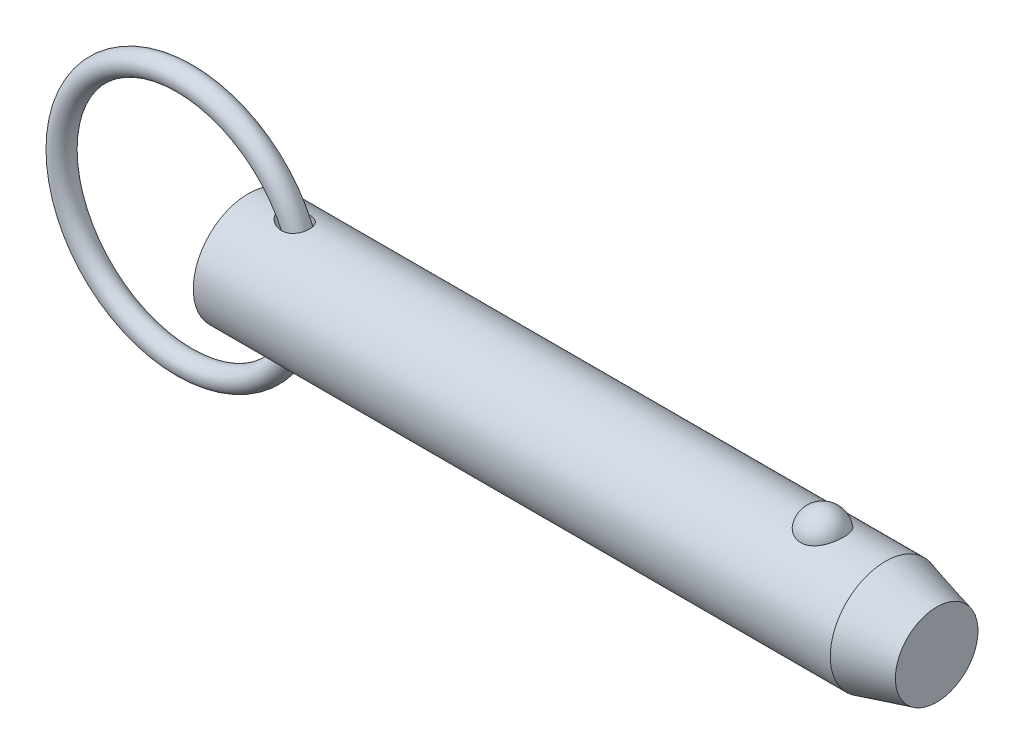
ISO-10303-21;
HEADER;
FILE_DESCRIPTION(('STEP AP214'),'2;1');
FILE_NAME('part.step','',(''),(''),'','','');
FILE_SCHEMA(('AUTOMOTIVE_DESIGN { 1 0 10303 214 1 1 1 1 }'));
ENDSEC;
DATA;
#1=APPLICATION_CONTEXT('core data for automotive mechanical design processes');
#2=APPLICATION_PROTOCOL_DEFINITION('international standard','automotive_design',2000,#1);
#3=PRODUCT_CONTEXT('',#1,'mechanical');
#4=PRODUCT('Part','Part','',(#3));
#5=PRODUCT_RELATED_PRODUCT_CATEGORY('part','',(#4));
#6=PRODUCT_DEFINITION_FORMATION('','',#4);
#7=PRODUCT_DEFINITION_CONTEXT('part definition',#1,'design');
#8=PRODUCT_DEFINITION('design','',#6,#7);
#9=PRODUCT_DEFINITION_SHAPE('','',#8);
#10=(LENGTH_UNIT() NAMED_UNIT(*) SI_UNIT(.MILLI.,.METRE.));
#11=(NAMED_UNIT(*) PLANE_ANGLE_UNIT() SI_UNIT($,.RADIAN.));
#12=(NAMED_UNIT(*) SI_UNIT($,.STERADIAN.) SOLID_ANGLE_UNIT());
#13=UNCERTAINTY_MEASURE_WITH_UNIT(LENGTH_MEASURE(1.E-05),#10,'distance_accuracy_value','');
#14=(GEOMETRIC_REPRESENTATION_CONTEXT(3) GLOBAL_UNCERTAINTY_ASSIGNED_CONTEXT((#13)) GLOBAL_UNIT_ASSIGNED_CONTEXT((#10,
#11,#12)) REPRESENTATION_CONTEXT('',''));
#15=CARTESIAN_POINT('',(0.,0.,0.));
#16=DIRECTION('',(0.,0.,1.));
#17=DIRECTION('',(1.,0.,0.));
#18=AXIS2_PLACEMENT_3D('',#15,#16,#17);
#19=CARTESIAN_POINT('',(-8.23730968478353,0.,0.));
#20=DIRECTION('',(0.,0.,1.));
#21=DIRECTION('',(1.,0.,0.));
#22=AXIS2_PLACEMENT_3D('',#19,#20,#21);
#23=TOROIDAL_SURFACE('',#22,15.875,1.422);
#24=CARTESIAN_POINT('',(9.05969031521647,0.,0.));
#25=VERTEX_POINT('',#24);
#26=VERTEX_LOOP('',#25);
#27=FACE_BOUND('',#26,.T.);
#28=ADVANCED_FACE('P0_F12',(#27),#23,.T.);
#29=CLOSED_SHELL('',(#28));
#30=MANIFOLD_SOLID_BREP('P0_B1',#29);
#31=CARTESIAN_POINT('',(0.,0.,0.));
#32=DIRECTION('',(1.,0.,0.));
#33=DIRECTION('',(0.,0.,-1.));
#34=AXIS2_PLACEMENT_3D('',#31,#32,#33);
#35=CYLINDRICAL_SURFACE('',#34,7.11);
#36=CARTESIAN_POINT('',(3.98467340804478,7.10072679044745,-0.363013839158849));
#37=CARTESIAN_POINT('',(4.00971652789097,7.09600153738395,-0.45539194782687));
#38=CARTESIAN_POINT('',(4.04401947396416,7.08958406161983,-0.545230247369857));
#39=CARTESIAN_POINT('',(4.12810160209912,7.07427055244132,-0.717157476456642));
#40=CARTESIAN_POINT('',(4.17791765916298,7.06536861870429,-0.799227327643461));
#41=CARTESIAN_POINT('',(4.28924471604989,7.04620300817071,-0.953469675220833));
#42=CARTESIAN_POINT('',(4.35063580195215,7.035953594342,-1.02573162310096));
#43=CARTESIAN_POINT('',(4.48282610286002,7.01493313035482,-1.16081412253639));
#44=CARTESIAN_POINT('',(4.55362244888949,7.00416223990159,-1.22363754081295));
#45=CARTESIAN_POINT('',(4.71659336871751,6.98090398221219,-1.35055080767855));
#46=CARTESIAN_POINT('',(4.81029272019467,6.96847103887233,-1.41269256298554));
#47=CARTESIAN_POINT('',(5.0057240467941,6.94515366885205,-1.52319699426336));
#48=CARTESIAN_POINT('',(5.10746392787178,6.93427079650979,-1.57154588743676));
#49=CARTESIAN_POINT('',(5.33503739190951,6.91346066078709,-1.66091325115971));
#50=CARTESIAN_POINT('',(5.46199550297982,6.90402388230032,-1.69921932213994));
#51=CARTESIAN_POINT('',(5.72084799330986,6.89024030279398,-1.75428261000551));
#52=CARTESIAN_POINT('',(5.85274301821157,6.88589416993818,-1.77103699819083));
#53=CARTESIAN_POINT('',(6.11557710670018,6.88337277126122,-1.78081990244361));
#54=CARTESIAN_POINT('',(6.24650031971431,6.88510489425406,-1.77420448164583));
#55=CARTESIAN_POINT('',(6.50446311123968,6.89478744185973,-1.73620392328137));
#56=CARTESIAN_POINT('',(6.6315075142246,6.90272978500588,-1.70485097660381));
#57=CARTESIAN_POINT('',(6.85933269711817,6.92243075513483,-1.62281888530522));
#58=CARTESIAN_POINT('',(6.96133251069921,6.93352131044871,-1.5753580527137));
#59=CARTESIAN_POINT('',(7.15436649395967,6.95824811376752,-1.46226310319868));
#60=CARTESIAN_POINT('',(7.24540699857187,6.97188287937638,-1.3966395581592));
#61=CARTESIAN_POINT('',(7.40446019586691,6.99838217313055,-1.25668991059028));
#62=CARTESIAN_POINT('',(7.473875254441,7.01118308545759,-1.18393777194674));
#63=CARTESIAN_POINT('',(7.59904891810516,7.03582803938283,-1.02736918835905));
#64=CARTESIAN_POINT('',(7.65481029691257,7.04767227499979,-0.943554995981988));
#65=CARTESIAN_POINT('',(7.74982438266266,7.06873077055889,-0.76979592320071));
#66=CARTESIAN_POINT('',(7.7894903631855,7.07800861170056,-0.680084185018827));
#67=CARTESIAN_POINT('',(7.85354088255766,7.09334756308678,-0.495102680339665));
#68=CARTESIAN_POINT('',(7.87792559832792,7.09940871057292,-0.399832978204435));
#69=CARTESIAN_POINT('',(7.9108898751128,7.10766731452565,-0.206294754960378));
#70=CARTESIAN_POINT('',(7.91944662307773,7.10985919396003,-0.108022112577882));
#71=CARTESIAN_POINT('',(7.920501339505,7.11012756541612,0.0886168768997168));
#72=CARTESIAN_POINT('',(7.91299895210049,7.10820396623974,0.186983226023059));
#73=CARTESIAN_POINT('',(7.88205794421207,7.10043733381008,0.381270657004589));
#74=CARTESIAN_POINT('',(7.85857985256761,7.09458459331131,0.477185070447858));
#75=CARTESIAN_POINT('',(7.79617406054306,7.07958431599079,0.663575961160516));
#76=CARTESIAN_POINT('',(7.75724672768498,7.07043685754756,0.754052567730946));
#77=CARTESIAN_POINT('',(7.66496731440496,7.04987259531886,0.926798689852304));
#78=CARTESIAN_POINT('',(7.61164530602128,7.0384605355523,1.00908483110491));
#79=CARTESIAN_POINT('',(7.49191707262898,7.01461776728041,1.16333092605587));
#80=CARTESIAN_POINT('',(7.42551210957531,7.00218715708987,1.235291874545));
#81=CARTESIAN_POINT('',(7.28164031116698,6.97770944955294,1.36680167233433));
#82=CARTESIAN_POINT('',(7.20420170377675,6.96566146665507,1.42638126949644));
#83=CARTESIAN_POINT('',(7.0403906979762,6.94319963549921,1.53199377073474));
#84=CARTESIAN_POINT('',(6.95401827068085,6.93278579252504,1.57802663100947));
#85=CARTESIAN_POINT('',(6.7731858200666,6.91444459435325,1.65656940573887));
#86=CARTESIAN_POINT('',(6.67860569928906,6.90656682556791,1.68881327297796));
#87=CARTESIAN_POINT('',(6.48544119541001,6.89422806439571,1.73849768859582));
#88=CARTESIAN_POINT('',(6.38685561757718,6.88976809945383,1.755933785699));
#89=CARTESIAN_POINT('',(6.18089829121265,6.88429907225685,1.77726234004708));
#90=CARTESIAN_POINT('',(6.07340937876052,6.88356485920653,1.78007646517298));
#91=CARTESIAN_POINT('',(5.85921220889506,6.886086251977,1.77029087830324));
#92=CARTESIAN_POINT('',(5.75250426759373,6.88934339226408,1.75768523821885));
#93=CARTESIAN_POINT('',(5.52848027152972,6.89994454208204,1.71563399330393));
#94=CARTESIAN_POINT('',(5.41155168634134,6.90775772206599,1.68424184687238));
#95=CARTESIAN_POINT('',(5.18376466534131,6.92670168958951,1.60454711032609));
#96=CARTESIAN_POINT('',(5.07291446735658,6.9378368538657,1.5562221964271));
#97=CARTESIAN_POINT('',(4.84835244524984,6.96347168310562,1.43744827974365));
#98=CARTESIAN_POINT('',(4.73562531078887,6.97820486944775,1.36517310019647));
#99=CARTESIAN_POINT('',(4.52504912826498,7.00822340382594,1.20158053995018));
#100=CARTESIAN_POINT('',(4.42717478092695,7.02350775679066,1.11029618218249));
#101=CARTESIAN_POINT('',(4.27935716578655,7.04784659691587,0.940654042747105));
#102=CARTESIAN_POINT('',(4.2239722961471,7.05736064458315,0.867099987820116));
#103=CARTESIAN_POINT('',(4.12558347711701,7.07469854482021,0.711919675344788));
#104=CARTESIAN_POINT('',(4.08256922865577,7.0825238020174,0.630300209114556));
#105=CARTESIAN_POINT('',(4.01142860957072,7.09565978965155,0.459428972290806));
#106=CARTESIAN_POINT('',(3.98346043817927,7.10094374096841,0.370107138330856));
#107=CARTESIAN_POINT('',(3.95517285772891,7.1063173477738,0.233358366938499));
#108=CARTESIAN_POINT('',(3.94802115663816,7.1076831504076,0.187321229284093));
#109=CARTESIAN_POINT('',(3.93842121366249,7.10951900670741,0.0947476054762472));
#110=CARTESIAN_POINT('',(3.93597129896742,7.10998937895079,0.0482113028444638));
#111=CARTESIAN_POINT('',(3.93584361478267,7.11001358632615,-0.0598597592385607));
#112=CARTESIAN_POINT('',(3.9399538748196,7.10922402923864,-0.121405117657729));
#113=CARTESIAN_POINT('',(3.95632793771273,7.10609781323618,-0.243320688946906));
#114=CARTESIAN_POINT('',(3.96859135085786,7.10376122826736,-0.303690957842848));
#115=CARTESIAN_POINT('',(3.98467340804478,7.10072679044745,-0.363013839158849));
#116=B_SPLINE_CURVE_WITH_KNOTS('',3,(#36,#37,#38,#39,#40,#41,#42,#43,#44,#45,#46,#47,#48,#49,
#50,#51,#52,#53,#54,#55,#56,#57,#58,#59,#60,#61,#62,#63,#64,#65,#66,#67,#68,#69,#70,#71,#72,#73,
#74,#75,#76,#77,#78,#79,#80,#81,#82,#83,#84,#85,#86,#87,#88,#89,#90,#91,#92,#93,#94,#95,#96,#97,
#98,#99,#100,#101,#102,#103,#104,#105,#106,#107,#108,#109,#110,#111,#112,#113,#114,#115),
.UNSPECIFIED.,.T.,.F.,(4,2,2,2,2,2,2,2,2,2,2,2,2,2,2,2,2,2,2,2,2,2,2,2,2,2,2,2,2,2,2,2,2,2,2,2,
2,2,2,4),(0.,0.287206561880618,0.575101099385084,0.860162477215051,1.14513709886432,
1.48324846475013,1.82169652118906,2.21865672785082,2.6156690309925,3.00665870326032,
3.39714041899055,3.73437585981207,4.07141541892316,4.37402271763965,4.67656849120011,
4.97076150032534,5.26495110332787,5.55956439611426,5.85418421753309,6.14953461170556,
6.44487798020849,6.73960905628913,7.03431171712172,7.32827352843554,7.6222362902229,
7.9216396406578,8.22113296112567,8.54242840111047,8.86384740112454,9.22635035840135,
9.58933304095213,9.99153142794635,10.3930368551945,10.6697219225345,10.9461759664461,
11.2254825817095,11.3650959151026,11.5046595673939,11.6891051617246,11.8735419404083),.UNSPECIFIED.);
#117=CARTESIAN_POINT('',(3.98467340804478,7.10072679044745,-0.363013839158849));
#118=VERTEX_POINT('',#117);
#119=EDGE_CURVE('P1_E40',#118,#118,#116,.T.);
#120=ORIENTED_EDGE('',*,*,#119,.T.);
#121=EDGE_LOOP('',(#120));
#122=FACE_BOUND('',#121,.T.);
#123=CARTESIAN_POINT('',(82.2362796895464,0.,0.));
#124=DIRECTION('',(1.,0.,0.));
#125=DIRECTION('',(0.,0.,-1.));
#126=AXIS2_PLACEMENT_3D('',#123,#124,#125);
#127=CIRCLE('',#126,7.11);
#128=CARTESIAN_POINT('',(82.2362796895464,0.,-7.11));
#129=VERTEX_POINT('',#128);
#130=EDGE_CURVE('P1_E25',#129,#129,#127,.T.);
#131=ORIENTED_EDGE('',*,*,#130,.F.);
#132=EDGE_LOOP('',(#131));
#133=FACE_BOUND('',#132,.T.);
#134=CARTESIAN_POINT('',(0.,0.,0.));
#135=DIRECTION('',(1.,0.,0.));
#136=DIRECTION('',(0.,0.,-1.));
#137=AXIS2_PLACEMENT_3D('',#134,#135,#136);
#138=CIRCLE('',#137,7.11);
#139=CARTESIAN_POINT('',(0.,0.,-7.11));
#140=VERTEX_POINT('',#139);
#141=EDGE_CURVE('P1_E9',#140,#140,#138,.T.);
#142=ORIENTED_EDGE('',*,*,#141,.T.);
#143=EDGE_LOOP('',(#142));
#144=FACE_BOUND('',#143,.T.);
#145=CARTESIAN_POINT('',(74.129258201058,6.53646663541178,2.79762469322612));
#146=CARTESIAN_POINT('',(73.9844296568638,6.53647876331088,2.79761243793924));
#147=CARTESIAN_POINT('',(73.839368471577,6.54144531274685,2.78608115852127));
#148=CARTESIAN_POINT('',(73.5532920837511,6.56077791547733,2.74023282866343));
#149=CARTESIAN_POINT('',(73.4122884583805,6.57516852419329,2.70585624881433));
#150=CARTESIAN_POINT('',(73.1388833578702,6.61165072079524,2.61544042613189));
#151=CARTESIAN_POINT('',(73.0064602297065,6.63372195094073,2.55945840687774));
#152=CARTESIAN_POINT('',(72.7532337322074,6.68316012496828,2.42742958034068));
#153=CARTESIAN_POINT('',(72.6324254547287,6.71052481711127,2.35139129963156));
#154=CARTESIAN_POINT('',(72.4016372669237,6.76860821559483,2.17866150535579));
#155=CARTESIAN_POINT('',(72.2920857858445,6.79940242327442,2.08142342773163));
#156=CARTESIAN_POINT('',(72.0903340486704,6.86050242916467,1.87020907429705));
#157=CARTESIAN_POINT('',(71.9981390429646,6.89080807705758,1.75622775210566));
#158=CARTESIAN_POINT('',(71.8292547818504,6.94923069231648,1.50900646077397));
#159=CARTESIAN_POINT('',(71.7534289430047,6.97719213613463,1.37513873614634));
#160=CARTESIAN_POINT('',(71.6242063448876,7.02647251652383,1.09584817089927));
#161=CARTESIAN_POINT('',(71.5708109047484,7.04779106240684,0.950424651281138));
#162=CARTESIAN_POINT('',(71.4871019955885,7.08180248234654,0.650508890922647));
#163=CARTESIAN_POINT('',(71.4570253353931,7.09440672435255,0.495940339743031));
#164=CARTESIAN_POINT('',(71.421473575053,7.10935121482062,0.183515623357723));
#165=CARTESIAN_POINT('',(71.4159974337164,7.11169189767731,0.025659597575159));
#166=CARTESIAN_POINT('',(71.429700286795,7.10589702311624,-0.287512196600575));
#167=CARTESIAN_POINT('',(71.4486823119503,7.0978451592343,-0.442838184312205));
#168=CARTESIAN_POINT('',(71.5105745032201,7.07221860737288,-0.747830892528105));
#169=CARTESIAN_POINT('',(71.5534850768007,7.05464375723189,-0.897497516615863));
#170=CARTESIAN_POINT('',(71.6624527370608,7.01171031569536,-1.1872286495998));
#171=CARTESIAN_POINT('',(71.7285458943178,6.98633960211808,-1.32727778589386));
#172=CARTESIAN_POINT('',(71.8825362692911,6.93042258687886,-1.59370324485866));
#173=CARTESIAN_POINT('',(71.9704355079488,6.89987580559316,-1.72007829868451));
#174=CARTESIAN_POINT('',(72.1669269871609,6.83659510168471,-1.95657345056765));
#175=CARTESIAN_POINT('',(72.2756640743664,6.80384697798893,-2.0665695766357));
#176=CARTESIAN_POINT('',(72.5109686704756,6.7400183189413,-2.26611005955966));
#177=CARTESIAN_POINT('',(72.6375350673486,6.70893767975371,-2.35565569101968));
#178=CARTESIAN_POINT('',(72.9028454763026,6.65264442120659,-2.51019726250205));
#179=CARTESIAN_POINT('',(73.0413230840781,6.62733449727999,-2.5756139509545));
#180=CARTESIAN_POINT('',(73.3285194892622,6.58495995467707,-2.68211134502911));
#181=CARTESIAN_POINT('',(73.4772343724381,6.56789220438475,-2.72320129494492));
#182=CARTESIAN_POINT('',(73.7726268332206,6.54478663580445,-2.77825810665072));
#183=CARTESIAN_POINT('',(73.9190295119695,6.53823639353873,-2.7934872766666));
#184=CARTESIAN_POINT('',(74.2124700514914,6.53532718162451,-2.80028921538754));
#185=CARTESIAN_POINT('',(74.3595077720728,6.53896606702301,-2.79186696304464));
#186=CARTESIAN_POINT('',(74.6449210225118,6.55570357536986,-2.75232178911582));
#187=CARTESIAN_POINT('',(74.7834221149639,6.56848455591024,-2.72196077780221));
#188=CARTESIAN_POINT('',(75.0531142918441,6.60173528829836,-2.64028774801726));
#189=CARTESIAN_POINT('',(75.184304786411,6.62220565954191,-2.58897404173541));
#190=CARTESIAN_POINT('',(75.4388462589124,6.6691792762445,-2.46547820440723));
#191=CARTESIAN_POINT('',(75.5619691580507,6.69580233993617,-2.39287266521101));
#192=CARTESIAN_POINT('',(75.7944418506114,6.75207041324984,-2.22915269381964));
#193=CARTESIAN_POINT('',(75.9037884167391,6.78171612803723,-2.13803393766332));
#194=CARTESIAN_POINT('',(76.111642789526,6.8426462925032,-1.93445592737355));
#195=CARTESIAN_POINT('',(76.2093178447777,6.87393748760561,-1.82114774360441));
#196=CARTESIAN_POINT('',(76.3850112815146,6.93345710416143,-1.5794778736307));
#197=CARTESIAN_POINT('',(76.4630261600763,6.96168497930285,-1.45111351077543));
#198=CARTESIAN_POINT('',(76.5999857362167,7.01307558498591,-1.17842708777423));
#199=CARTESIAN_POINT('',(76.6582588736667,7.03605262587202,-1.03373189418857));
#200=CARTESIAN_POINT('',(76.7510815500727,7.07340932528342,-0.735867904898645));
#201=CARTESIAN_POINT('',(76.7856311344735,7.08778900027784,-0.582699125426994));
#202=CARTESIAN_POINT('',(76.830274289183,7.10647639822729,-0.272420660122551));
#203=CARTESIAN_POINT('',(76.84039710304,7.11079616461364,-0.115315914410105));
#204=CARTESIAN_POINT('',(76.836061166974,7.10896059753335,0.198488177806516));
#205=CARTESIAN_POINT('',(76.8216031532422,7.10280557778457,0.35518753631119));
#206=CARTESIAN_POINT('',(76.7685727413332,7.08071500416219,0.662724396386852));
#207=CARTESIAN_POINT('',(76.7301505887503,7.06484039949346,0.81359224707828));
#208=CARTESIAN_POINT('',(76.6301012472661,7.0249589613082,1.10629159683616));
#209=CARTESIAN_POINT('',(76.5684724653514,7.00095156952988,1.24812247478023));
#210=CARTESIAN_POINT('',(76.4227668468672,6.94706632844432,1.51976439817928));
#211=CARTESIAN_POINT('',(76.3385448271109,6.91715085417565,1.6494901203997));
#212=CARTESIAN_POINT('',(76.1495861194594,6.85470565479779,1.89231285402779));
#213=CARTESIAN_POINT('',(76.0448501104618,6.82217601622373,2.0054104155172));
#214=CARTESIAN_POINT('',(75.8171030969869,6.75805358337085,2.21190674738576));
#215=CARTESIAN_POINT('',(75.694082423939,6.72646129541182,2.30529503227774));
#216=CARTESIAN_POINT('',(75.4327347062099,6.66789520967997,2.4695990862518));
#217=CARTESIAN_POINT('',(75.2944019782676,6.64092313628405,2.5405064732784));
#218=CARTESIAN_POINT('',(75.0111828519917,6.5957258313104,2.65560045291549));
#219=CARTESIAN_POINT('',(74.8666660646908,6.57724013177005,2.7005953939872));
#220=CARTESIAN_POINT('',(74.5715469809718,6.55006426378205,2.76587321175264));
#221=CARTESIAN_POINT('',(74.4209640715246,6.54134511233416,2.78622922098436));
#222=CARTESIAN_POINT('',(74.2230463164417,6.53697847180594,2.79642434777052));
#223=CARTESIAN_POINT('',(74.1761644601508,6.53646270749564,2.79762866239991));
#224=CARTESIAN_POINT('',(74.129258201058,6.53646663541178,2.79762469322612));
#225=B_SPLINE_CURVE_WITH_KNOTS('',3,(#145,#146,#147,#148,#149,#150,#151,#152,#153,#154,#155,
#156,#157,#158,#159,#160,#161,#162,#163,#164,#165,#166,#167,#168,#169,#170,#171,#172,#173,#174,
#175,#176,#177,#178,#179,#180,#181,#182,#183,#184,#185,#186,#187,#188,#189,#190,#191,#192,#193,
#194,#195,#196,#197,#198,#199,#200,#201,#202,#203,#204,#205,#206,#207,#208,#209,#210,#211,#212,
#213,#214,#215,#216,#217,#218,#219,#220,#221,#222,#223,#224),.UNSPECIFIED.,.T.,.F.,(4,2,2,2,2,2,
2,2,2,2,2,2,2,2,2,2,2,2,2,2,2,2,2,2,2,2,2,2,2,2,2,2,2,2,2,2,2,2,2,4),(0.,0.434355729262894,
0.869847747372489,1.30419416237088,1.73835621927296,2.18541922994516,2.6326172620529,
3.09954261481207,3.56649542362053,4.03813031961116,4.50974525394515,4.97758575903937,
5.4454342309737,5.91401389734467,6.38263700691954,6.85464418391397,7.32662193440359,
7.78992971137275,8.25306131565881,8.69285754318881,9.13256119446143,9.5576862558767,
9.98284556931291,10.4171106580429,10.851477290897,11.3079089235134,11.7644218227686,
12.2351898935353,12.7059570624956,13.1761603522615,13.6463495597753,14.1136200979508,
14.5809227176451,15.0513032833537,15.5216682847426,15.9922828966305,16.4630727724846,
16.9182457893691,17.3720644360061,17.5127411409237),.UNSPECIFIED.);
#226=CARTESIAN_POINT('',(74.129258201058,6.53646663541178,2.79762469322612));
#227=VERTEX_POINT('',#226);
#228=EDGE_CURVE('P1_E34',#227,#227,#225,.T.);
#229=ORIENTED_EDGE('',*,*,#228,.T.);
#230=EDGE_LOOP('',(#229));
#231=FACE_BOUND('',#230,.T.);
#232=CARTESIAN_POINT('',(3.98467340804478,-7.10072679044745,-0.363013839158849));
#233=CARTESIAN_POINT('',(3.96426456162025,-7.10457733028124,-0.287714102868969));
#234=CARTESIAN_POINT('',(3.95000501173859,-7.10730349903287,-0.210695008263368));
#235=CARTESIAN_POINT('',(3.93481801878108,-7.11020840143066,-0.0553038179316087));
#236=CARTESIAN_POINT('',(3.93388435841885,-7.11038832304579,0.0230676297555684));
#237=CARTESIAN_POINT('',(3.94541910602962,-7.10817995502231,0.178714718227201));
#238=CARTESIAN_POINT('',(3.95787987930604,-7.10579312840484,0.25599095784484));
#239=CARTESIAN_POINT('',(3.99523775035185,-7.09872642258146,0.407352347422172));
#240=CARTESIAN_POINT('',(4.02014065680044,-7.09404547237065,0.481435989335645));
#241=CARTESIAN_POINT('',(4.08119600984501,-7.08278363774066,0.625775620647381));
#242=CARTESIAN_POINT('',(4.11749458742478,-7.07617815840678,0.695967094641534));
#243=CARTESIAN_POINT('',(4.19940836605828,-7.06165305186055,0.830508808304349));
#244=CARTESIAN_POINT('',(4.24502952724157,-7.0537325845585,0.894855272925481));
#245=CARTESIAN_POINT('',(4.36790232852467,-7.03310314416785,1.04688574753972));
#246=CARTESIAN_POINT('',(4.44977459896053,-7.01993229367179,1.13078695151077));
#247=CARTESIAN_POINT('',(4.62610796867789,-6.99351259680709,1.28411726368));
#248=CARTESIAN_POINT('',(4.7205898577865,-6.98026365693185,1.35352197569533));
#249=CARTESIAN_POINT('',(4.92036507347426,-6.9549104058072,1.47831921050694));
#250=CARTESIAN_POINT('',(5.02579054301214,-6.94282458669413,1.53350332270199));
#251=CARTESIAN_POINT('',(5.24378330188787,-6.92129098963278,1.62793610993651));
#252=CARTESIAN_POINT('',(5.35635066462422,-6.91184323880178,1.66718462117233));
#253=CARTESIAN_POINT('',(5.60134354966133,-6.89573491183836,1.73269893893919));
#254=CARTESIAN_POINT('',(5.73444697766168,-6.8895970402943,1.75661057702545));
#255=CARTESIAN_POINT('',(6.00300738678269,-6.88344616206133,1.78057487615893));
#256=CARTESIAN_POINT('',(6.13846360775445,-6.88343121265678,1.78063510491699));
#257=CARTESIAN_POINT('',(6.39660470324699,-6.88981379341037,1.75576480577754));
#258=CARTESIAN_POINT('',(6.51947843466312,-6.89572457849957,1.73273121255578));
#259=CARTESIAN_POINT('',(6.75813770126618,-6.91274434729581,1.66352936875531));
#260=CARTESIAN_POINT('',(6.87393155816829,-6.92384709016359,1.61738888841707));
#261=CARTESIAN_POINT('',(7.07801861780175,-6.94787316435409,1.51052664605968));
#262=CARTESIAN_POINT('',(7.16789841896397,-6.96033024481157,1.45271574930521));
#263=CARTESIAN_POINT('',(7.33546773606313,-6.98638661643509,1.32171912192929));
#264=CARTESIAN_POINT('',(7.41316182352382,-6.99998547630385,1.24853918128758));
#265=CARTESIAN_POINT('',(7.54861420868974,-7.02559503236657,1.09486170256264));
#266=CARTESIAN_POINT('',(7.60741145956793,-7.03764930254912,1.01528346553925));
#267=CARTESIAN_POINT('',(7.71070740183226,-7.0598657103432,0.847099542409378));
#268=CARTESIAN_POINT('',(7.75520788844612,-7.0700280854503,0.758494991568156));
#269=CARTESIAN_POINT('',(7.82836147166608,-7.08722075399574,0.575936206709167));
#270=CARTESIAN_POINT('',(7.85719783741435,-7.09428707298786,0.482058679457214));
#271=CARTESIAN_POINT('',(7.89918378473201,-7.10470260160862,0.29065874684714));
#272=CARTESIAN_POINT('',(7.91233308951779,-7.10805174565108,0.193136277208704));
#273=CARTESIAN_POINT('',(7.92267451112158,-7.11067890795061,-0.00313968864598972));
#274=CARTESIAN_POINT('',(7.91981203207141,-7.10994299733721,-0.10189624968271));
#275=CARTESIAN_POINT('',(7.89806489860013,-7.10444651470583,-0.297516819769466));
#276=CARTESIAN_POINT('',(7.87918005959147,-7.09968589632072,-0.394380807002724));
#277=CARTESIAN_POINT('',(7.82577988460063,-7.0866471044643,-0.58355375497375));
#278=CARTESIAN_POINT('',(7.79124976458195,-7.07836560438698,-0.675858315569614));
#279=CARTESIAN_POINT('',(7.70736343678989,-7.05919003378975,-0.853167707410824));
#280=CARTESIAN_POINT('',(7.65800801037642,-7.04829610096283,-0.938172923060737));
#281=CARTESIAN_POINT('',(7.54590141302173,-7.02513961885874,-1.09819812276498));
#282=CARTESIAN_POINT('',(7.48319521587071,-7.01288172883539,-1.17325029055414));
#283=CARTESIAN_POINT('',(7.34599775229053,-6.98832192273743,-1.31164333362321));
#284=CARTESIAN_POINT('',(7.27150757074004,-6.97602001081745,-1.37498528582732));
#285=CARTESIAN_POINT('',(7.11277776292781,-6.95268608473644,-1.48849974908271));
#286=CARTESIAN_POINT('',(7.02852525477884,-6.94165578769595,-1.53865456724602));
#287=CARTESIAN_POINT('',(6.85282430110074,-6.92200320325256,-1.62478650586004));
#288=CARTESIAN_POINT('',(6.76137511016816,-6.91338116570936,-1.66076215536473));
#289=CARTESIAN_POINT('',(6.57061179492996,-6.89906044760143,-1.71930563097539));
#290=CARTESIAN_POINT('',(6.47113516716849,-6.89347290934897,-1.74136795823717));
#291=CARTESIAN_POINT('',(6.26989833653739,-6.88605020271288,-1.7704895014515));
#292=CARTESIAN_POINT('',(6.16813737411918,-6.88421630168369,-1.77754365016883));
#293=CARTESIAN_POINT('',(5.95492537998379,-6.88424071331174,-1.77745174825));
#294=CARTESIAN_POINT('',(5.8434768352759,-6.88646827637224,-1.76888555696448));
#295=CARTESIAN_POINT('',(5.62307560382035,-6.89483827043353,-1.73596677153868));
#296=CARTESIAN_POINT('',(5.51412477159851,-6.90098351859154,-1.71160281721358));
#297=CARTESIAN_POINT('',(5.28644478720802,-6.91743803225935,-1.64393691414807));
#298=CARTESIAN_POINT('',(5.16837217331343,-6.92819628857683,-1.59852806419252));
#299=CARTESIAN_POINT('',(4.94091825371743,-6.95234836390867,-1.4899796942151));
#300=CARTESIAN_POINT('',(4.83153887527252,-6.96574276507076,-1.42683625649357));
#301=CARTESIAN_POINT('',(4.63576710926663,-6.99209234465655,-1.29112257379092));
#302=CARTESIAN_POINT('',(4.54816728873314,-7.00494184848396,-1.22027748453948));
#303=CARTESIAN_POINT('',(4.38554897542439,-7.03019055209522,-1.0652111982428));
#304=CARTESIAN_POINT('',(4.31052141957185,-7.04259007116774,-0.980999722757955));
#305=CARTESIAN_POINT('',(4.18551811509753,-7.0640229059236,-0.811206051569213));
#306=CARTESIAN_POINT('',(4.13358417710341,-7.07328321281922,-0.727107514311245));
#307=CARTESIAN_POINT('',(4.04607461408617,-7.0891994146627,-0.550580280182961));
#308=CARTESIAN_POINT('',(4.01046401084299,-7.09586087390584,-0.458169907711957));
#309=CARTESIAN_POINT('',(3.98467340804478,-7.10072679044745,-0.363013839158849));
#310=B_SPLINE_CURVE_WITH_KNOTS('',3,(#232,#233,#234,#235,#236,#237,#238,#239,#240,#241,#242,
#243,#244,#245,#246,#247,#248,#249,#250,#251,#252,#253,#254,#255,#256,#257,#258,#259,#260,#261,
#262,#263,#264,#265,#266,#267,#268,#269,#270,#271,#272,#273,#274,#275,#276,#277,#278,#279,#280,
#281,#282,#283,#284,#285,#286,#287,#288,#289,#290,#291,#292,#293,#294,#295,#296,#297,#298,#299,
#300,#301,#302,#303,#304,#305,#306,#307,#308,#309),.UNSPECIFIED.,.T.,.F.,(4,2,2,2,2,2,2,2,2,2,2,
2,2,2,2,2,2,2,2,2,2,2,2,2,2,2,2,2,2,2,2,2,2,2,2,2,2,2,4),(0.,0.23402065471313,0.467932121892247,
0.701710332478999,0.935597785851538,1.17261620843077,1.40978663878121,1.76177576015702,
2.11435255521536,2.47183528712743,2.8293216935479,3.23332937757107,3.63720887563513,
4.01042610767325,4.38319587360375,4.70425151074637,5.02518641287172,5.32277979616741,
5.62033579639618,5.91433101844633,6.2083314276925,6.50333490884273,6.79834178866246,
7.09362801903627,7.38889868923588,7.6831900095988,7.9774542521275,8.27211131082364,
8.56679892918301,8.8716552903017,9.17661456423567,9.51069129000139,9.84500851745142,
10.2243046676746,10.6036846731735,10.9425776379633,11.2812252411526,11.5775945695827,
11.8733258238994),.UNSPECIFIED.);
#311=CARTESIAN_POINT('',(3.98467340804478,-7.10072679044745,-0.363013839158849));
#312=VERTEX_POINT('',#311);
#313=EDGE_CURVE('P1_E17',#312,#312,#310,.T.);
#314=ORIENTED_EDGE('',*,*,#313,.T.);
#315=EDGE_LOOP('',(#314));
#316=FACE_BOUND('',#315,.T.);
#317=ADVANCED_FACE('P1_F13',(#122,#133,#144,#231,#316),#35,.T.);
#318=CARTESIAN_POINT('',(0.,0.,0.));
#319=DIRECTION('',(-1.,0.,0.));
#320=DIRECTION('',(0.,0.,1.));
#321=AXIS2_PLACEMENT_3D('',#318,#319,#320);
#322=PLANE('',#321);
#323=ORIENTED_EDGE('',*,*,#141,.F.);
#324=EDGE_LOOP('',(#323));
#325=FACE_BOUND('',#324,.T.);
#326=ADVANCED_FACE('P1_F15',(#325),#322,.T.);
#327=CARTESIAN_POINT('',(88.87,0.,0.));
#328=DIRECTION('',(-1.,0.,0.));
#329=DIRECTION('',(0.,0.,1.));
#330=AXIS2_PLACEMENT_3D('',#327,#328,#329);
#331=CONICAL_SURFACE('',#330,5.33250000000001,0.26179938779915);
#332=ORIENTED_EDGE('',*,*,#130,.T.);
#333=EDGE_LOOP('',(#332));
#334=FACE_BOUND('',#333,.T.);
#335=CARTESIAN_POINT('',(88.87,0.,0.));
#336=DIRECTION('',(1.,0.,0.));
#337=DIRECTION('',(0.,0.,-1.));
#338=AXIS2_PLACEMENT_3D('',#335,#336,#337);
#339=CIRCLE('',#338,5.33250000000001);
#340=CARTESIAN_POINT('',(88.87,0.,-5.33250000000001));
#341=VERTEX_POINT('',#340);
#342=EDGE_CURVE('P1_E30',#341,#341,#339,.T.);
#343=ORIENTED_EDGE('',*,*,#342,.F.);
#344=EDGE_LOOP('',(#343));
#345=FACE_BOUND('',#344,.T.);
#346=ADVANCED_FACE('P1_F55',(#334,#345),#331,.T.);
#347=CARTESIAN_POINT('',(88.87,5.33250000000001,0.));
#348=DIRECTION('',(1.,0.,0.));
#349=DIRECTION('',(0.,0.,-1.));
#350=AXIS2_PLACEMENT_3D('',#347,#348,#349);
#351=PLANE('',#350);
#352=ORIENTED_EDGE('',*,*,#342,.T.);
#353=EDGE_LOOP('',(#352));
#354=FACE_BOUND('',#353,.T.);
#355=ADVANCED_FACE('P1_F51',(#354),#351,.T.);
#356=CARTESIAN_POINT('',(74.129258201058,6.399,0.));
#357=DIRECTION('',(-1.,0.,0.));
#358=DIRECTION('',(0.,-1.,0.));
#359=AXIS2_PLACEMENT_3D('',#356,#357,#358);
#360=SPHERICAL_SURFACE('',#359,2.801);
#361=ORIENTED_EDGE('',*,*,#228,.F.);
#362=EDGE_LOOP('',(#361));
#363=FACE_BOUND('',#362,.T.);
#364=ADVANCED_FACE('P1_F46',(#363),#360,.T.);
#365=CARTESIAN_POINT('',(-8.23730968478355,0.,0.));
#366=DIRECTION('',(0.,0.,1.));
#367=DIRECTION('',(1.,0.,0.));
#368=AXIS2_PLACEMENT_3D('',#365,#366,#367);
#369=TOROIDAL_SURFACE('',#368,15.875,1.7775);
#370=ORIENTED_EDGE('',*,*,#313,.F.);
#371=EDGE_LOOP('',(#370));
#372=FACE_BOUND('',#371,.T.);
#373=ORIENTED_EDGE('',*,*,#119,.F.);
#374=EDGE_LOOP('',(#373));
#375=FACE_BOUND('',#374,.T.);
#376=ADVANCED_FACE('P1_F50',(#372,#375),#369,.F.);
#377=CLOSED_SHELL('',(#317,#326,#346,#355,#364,#376));
#378=MANIFOLD_SOLID_BREP('P1_B1',#377);
#379=ADVANCED_BREP_SHAPE_REPRESENTATION('',(#18,#30,#378),#14);
#380=SHAPE_DEFINITION_REPRESENTATION(#9,#379);
ENDSEC;
END-ISO-10303-21;
